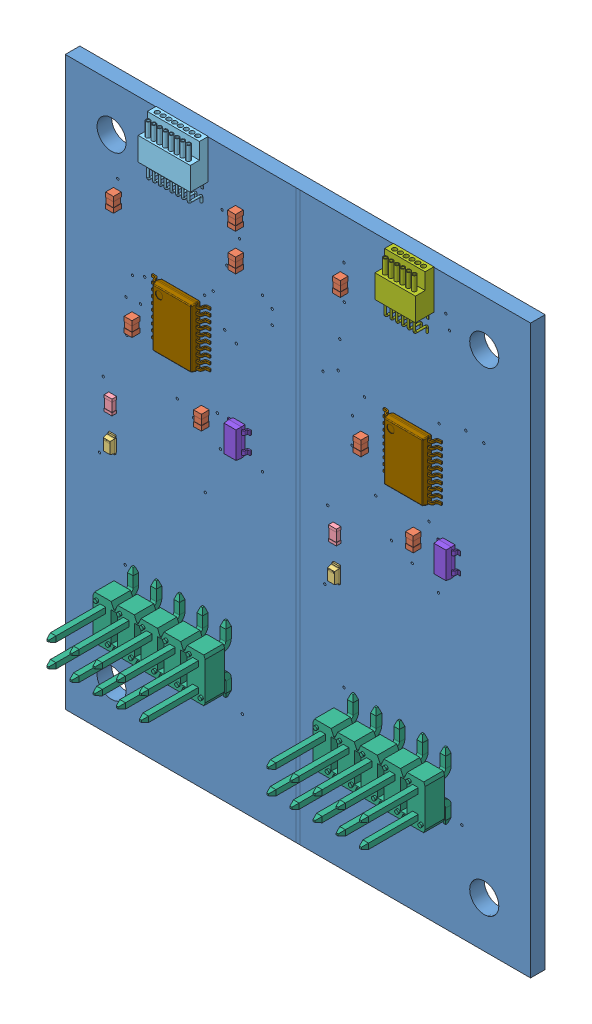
SolidWorks assembly lvds_adapter_v2.SLDASM, configuration Default (file format 15000). Lengths in mm.
Overall size (51.05 62.28 11.26).
21 component instances, 9 part files, 47 mates.
Components (placement in the parent):
- lvds_adapter_v2_PCB-1: lvds_adapter_v2_PCB.SLDPRT [Default] at origin size (51.05 62.23 1.6)
- Capacitor 0603-1: Capacitor 0603.SLDPRT [Default] at (7.747 40.64 1.63) x (0 -1 0) z (-1 0 0) size (1.6 0.86 0.86)
- Capacitor 0603-2: Capacitor 0603.SLDPRT [Default] at (15.367 35.56 1.63) x (0 -1 0) z (-1 0 0) size (1.6 0.86 0.86)
- Capacitor 0603-3: Capacitor 0603.SLDPRT [Default] at (5.715 51.435 1.63) x (0 -1 0) z (-1 0 0) size (1.6 0.86 0.86)
- Capacitor 0603-4: Capacitor 0603.SLDPRT [Default] at (19.1008 56.4134 1.63) x (0 -1 0) z (-1 0 0) size (1.6 0.86 0.86)
- Capacitor 0603-5: Capacitor 0603.SLDPRT [Default] at (19.1262 52.3748 1.63) x (0 -1 0) z (-1 0 0) size (1.6 0.86 0.86)
- Capacitor 0603-6: Capacitor 0603.SLDPRT [Default] at (32.8676 41.8592 1.63) x (0 1 0) z (1 0 0) size (1.6 0.86 0.86)
- Capacitor 0603-7: Capacitor 0603.SLDPRT [Default] at (38.608 35.6108 1.63) x (0 -1 0) z (-1 0 0) size (1.6 0.86 0.86)
- Capacitor 0603-8: Capacitor 0603.SLDPRT [Default] at (30.607 55.88 1.63) x (0 -1 0) z (-1 0 0) size (1.6 0.86 0.86)
- LED 0603-1: LED 0603.SLDPRT [Default] at (5.207 27.94 1.6) x (0 1 0) z (0 0 1) size (1.8 0.92 0.68)
- LED 0603-2: LED 0603.SLDPRT [Default] at (29.8196 27.8892 1.6) x (0 1 0) z (0 0 1) size (1.8 0.92 0.68)
- Resistor 0603-1: Resistor 0603.SLDPRT [Default] at (5.207 31.75 1.63) x (0 1 0) z (1 0 0) size (1.6 0.51 0.86)
- Resistor 0603-2: Resistor 0603.SLDPRT [Default] at (29.8196 31.6992 1.63) x (0 1 0) z (1 0 0) size (1.6 0.51 0.86)
- A79633-001-1: A79633-001.SLDPRT [Default] at (12.827 57.9628 1.6) x (-1 0 0) z (0 1 0) size (5.72 2.06 6.53)
- header_5x2_100mil-1: header_5x2_100mil.SLDPRT [Default] at (12.827 13.97 3.09) size (12.3 7.29 9.66)
- header_5x2_100mil-2: header_5x2_100mil.SLDPRT [Default] at (36.957 13.97 3.09) size (12.3 7.29 9.66)
- A79623-001-1: A79623-001.SLDPRT [Default] at (38.227 57.9628 1.6) x (-1 0 0) z (0 1 0) size (4.45 2.05 6.53)
- SOT 23-5-1: SOT 23-5.SLDPRT [Default] at (19.177 35.56 2.15) x (0 -1 0) z (-1 0 0) size (3 1.1 2.5)
- SOT 23-5-2: SOT 23-5.SLDPRT [Default] at (42.1132 35.56 2.05) x (0 -1 0) z (-1 0 0) size (3 1.1 2.5)
- TSSOP-20-1: TSSOP-20.SLDPRT [Default] at (12.827 43.18 1.6) size (6.4 6.5 1.13)
- TSSOP-20-2: TSSOP-20.SLDPRT [Default] at (38.227 43.18 1.6) size (6.4 6.5 1.13)
Mates (geometry in assembly coordinates):
- Parallel6: parallel aligned: plane of lvds_adapter_v2-1 through (0 0 1.6) normal (0 -1 0); plane of TSSOP-20-1 through (10.627 39.93 1.73) normal (0 -1 0)
- Parallel8: parallel aligned: plane of lvds_adapter_v2-1 through (0 0 1.6) normal (0 -1 0); plane of TSSOP-20-2 through (36.027 39.93 1.73) normal (0 -1 0)
- Parallel9: parallel aligned: plane of lvds_adapter_v2-1 through (51.054 62.23 1.6) normal (0 1 0); plane of A79633-001-1 through (12.827 62.2808 1.6) normal (0 1 0)
- Parallel10: parallel aligned: plane of lvds_adapter_v2-1 through (51.054 62.23 1.6) normal (0 1 0); plane of A79623-001-1 through (36.0045 62.2808 1.6) normal (0 1 0)
- Parallel11: parallel aligned: plane of lvds_adapter_v2-1 through (0 62.23 1.6) normal (-1 0 0); plane of header_5x2_100mil-1 through (6.677 16.57 3.09) normal (-1 0 0)
- Parallel12: parallel aligned: plane of lvds_adapter_v2-1 through (51.054 0 1.6) normal (1 0 0); plane of header_5x2_100mil-2 through (43.107 11.37 3.09) normal (1 0 0)
- Coincident1: coincident anti-aligned: plane of lvds_adapter_v2-1 through (0 0 1.6) normal (0 0 1); plane of A79633-001-1 through (12.827 57.9628 1.6) normal (0 0 -1)
- Parallel13: parallel anti-aligned: plane of lvds_adapter_v2-1 through (0 0 1.6) normal (0 0 1); plane of TSSOP-20-1 through (12.827 43.18 1.73) normal (0 0 -1)
- Coincident3: coincident: plane of lvds_adapter_v2-1 through (0 0 1.6) normal (0 0 1); line of TSSOP-20-1 through (9.6375 40.3775 1.6) axis (0 -1 0)
- Parallel14: parallel aligned: plane of lvds_adapter_v2-1 through (0 0 1.6) normal (0 -1 0); plane of TSSOP-20-1 through (10.627 39.93 1.73) normal (0 -1 0)
- Coincident4: coincident anti-aligned: plane of lvds_adapter_v2-1 through (0 0 1.6) normal (0 0 1); plane of header_5x2_100mil-1 through (7.753 14.6215 1.6) normal (0 0 -1)
- Parallel15: parallel aligned: plane of lvds_adapter_v2-1 through (0 62.23 1.6) normal (-1 0 0); plane of header_5x2_100mil-1 through (6.677 16.57 3.09) normal (-1 0 0)
- Coincident5: coincident anti-aligned: plane of lvds_adapter_v2-1 through (0 0 1.6) normal (0 0 1); plane of A79623-001-1 through (38.227 57.9628 1.6) normal (0 0 -1)
- Parallel16: parallel aligned: plane of lvds_adapter_v2-1 through (51.054 62.23 1.6) normal (0 1 0); plane of A79623-001-1 through (36.0045 62.2808 1.6) normal (0 1 0)
- Parallel17: parallel aligned: plane of lvds_adapter_v2-1 through (0 0 1.6) normal (0 -1 0); plane of TSSOP-20-2 through (36.027 39.93 1.73) normal (0 -1 0)
- Coincident7: coincident: plane of lvds_adapter_v2-1 through (0 0 1.6) normal (0 0 1); line of TSSOP-20-2 through (41.4165 45.3325 1.6) axis (0 1 0)
- Parallel18: parallel anti-aligned: plane of lvds_adapter_v2-1 through (0 0 1.6) normal (0 0 1); plane of TSSOP-20-2 through (38.227 43.18 1.73) normal (0 0 -1)
- Coincident9: coincident anti-aligned: plane of lvds_adapter_v2-1 through (0 0 1.6) normal (0 0 1); plane of header_5x2_100mil-2 through (31.883 14.6215 1.6) normal (0 0 -1)
- Parallel19: parallel aligned: plane of lvds_adapter_v2-1 through (0 0 1.6) normal (0 -1 0); plane of header_5x2_100mil-2 through (43.307 11.555 5.22) normal (0 -1 0)
- Parallel21: parallel aligned: plane of lvds_adapter_v2-1 through (0 0 1.6) normal (0 -1 0); plane of SOT 23-5-1 through (17.0445 34.385 1.875) normal (0 -1 0)
- Coincident12: coincident anti-aligned: plane of lvds_adapter_v2-1 through (0 0 1.6) normal (0 0 1); plane of SOT 23-5-2 through (41.4132 37.06 1.6) normal (0 0 -1)
- Parallel22: parallel aligned: plane of lvds_adapter_v2-1 through (0 0 1.6) normal (0 -1 0); plane of SOT 23-5-2 through (39.9807 34.385 1.775) normal (0 -1 0)
- Coincident13: coincident anti-aligned: plane of lvds_adapter_v2-1 through (0 0 1.6) normal (0 0 1); plane of SOT 23-5-1 through (17.0445 36.735 1.6) normal (0 0 -1)
- Coincident14: coincident anti-aligned: plane of lvds_adapter_v2-1 through (0 0 1.6) normal (0 0 1); plane of Capacitor 0603-4 through (17.646 56.1134 1.6) normal (0 0 -1)
- Parallel23: parallel aligned: plane of lvds_adapter_v2-1 through (51.054 62.23 1.6) normal (0 1 0); plane of Capacitor 0603-4 through (19.5008 57.2134 2.43) normal (0 1 0)
- Coincident15: coincident anti-aligned: plane of lvds_adapter_v2-1 through (0 0 1.6) normal (0 0 1); plane of Capacitor 0603-5 through (17.6714 52.0748 1.6) normal (0 0 -1)
- Parallel24: parallel aligned: plane of lvds_adapter_v2-1 through (51.054 62.23 1.6) normal (0 1 0); plane of Capacitor 0603-5 through (19.5262 53.1748 2.43) normal (0 1 0)
- Coincident16: coincident anti-aligned: plane of lvds_adapter_v2-1 through (0 0 1.6) normal (0 0 1); plane of Capacitor 0603-3 through (4.2602 51.135 1.6) normal (0 0 -1)
- Parallel25: parallel aligned: plane of lvds_adapter_v2-1 through (51.054 62.23 1.6) normal (0 1 0); plane of Capacitor 0603-3 through (6.115 52.235 2.43) normal (0 1 0)
- Coincident17: coincident anti-aligned: plane of lvds_adapter_v2-1 through (0 0 1.6) normal (0 0 1); plane of Capacitor 0603-1 through (6.2922 40.34 1.6) normal (0 0 -1)
- Parallel26: parallel aligned: plane of lvds_adapter_v2-1 through (0 62.23 1.6) normal (-1 0 0); plane of Capacitor 0603-1 through (7.317 41.44 2.43) normal (-1 0 0)
- Coincident18: coincident anti-aligned: plane of lvds_adapter_v2-1 through (0 0 1.6) normal (0 0 1); plane of Capacitor 0603-2 through (13.9122 35.26 1.6) normal (0 0 -1)
- Parallel27: parallel aligned: plane of lvds_adapter_v2-1 through (0 62.23 1.6) normal (-1 0 0); plane of Capacitor 0603-2 through (14.937 36.36 2.43) normal (-1 0 0)
- Coincident19: coincident anti-aligned: plane of lvds_adapter_v2-1 through (0 0 1.6) normal (0 0 1); plane of Resistor 0603-1 through (6.2587 31.25 1.6) normal (0 0 -1)
- Parallel28: parallel aligned: plane of lvds_adapter_v2-1 through (0 62.23 1.6) normal (-1 0 0); plane of Resistor 0603-1 through (4.777 30.95 2.08) normal (-1 0 0)
- Coincident20: coincident anti-aligned: plane of lvds_adapter_v2-1 through (0 0 1.6) normal (0 0 1); plane of LED 0603-1 through (4.826 27.038 1.6) normal (0 0 -1)
- Parallel29: parallel aligned: plane of lvds_adapter_v2-1 through (0 62.23 1.6) normal (-1 0 0); plane of LED 0603-1 through (4.763 28.638 1.651) normal (-1 0 0)
- Coincident22: coincident anti-aligned: plane of lvds_adapter_v2-1 through (0 0 1.6) normal (0 0 1); plane of Capacitor 0603-8 through (29.1522 55.58 1.6) normal (0 0 -1)
- Parallel30: parallel aligned: plane of lvds_adapter_v2-1 through (51.054 62.23 1.6) normal (0 1 0); plane of Capacitor 0603-8 through (31.007 56.68 2.43) normal (0 1 0)
- Coincident23: coincident anti-aligned: plane of lvds_adapter_v2-1 through (0 0 1.6) normal (0 0 1); plane of Capacitor 0603-6 through (34.3224 42.1592 1.6) normal (0 0 -1)
- Parallel31: parallel aligned: plane of lvds_adapter_v2-1 through (51.054 62.23 1.6) normal (0 1 0); plane of Capacitor 0603-6 through (32.4676 42.6592 2.43) normal (0 1 0)
- Coincident24: coincident anti-aligned: plane of lvds_adapter_v2-1 through (0 0 1.6) normal (0 0 1); plane of Capacitor 0603-7 through (37.1532 35.9108 1.6) normal (0 0 -1)
- Parallel32: parallel aligned: plane of lvds_adapter_v2-1 through (51.054 62.23 1.6) normal (0 1 0); plane of Capacitor 0603-7 through (39.008 36.4108 2.43) normal (0 1 0)
- Coincident25: coincident anti-aligned: plane of lvds_adapter_v2-1 through (0 0 1.6) normal (0 0 1); plane of Resistor 0603-2 through (30.8713 32.1992 1.6) normal (0 0 -1)
- Parallel33: parallel aligned: plane of lvds_adapter_v2-1 through (51.054 62.23 1.6) normal (0 1 0); plane of Resistor 0603-2 through (29.4196 32.4992 2.08) normal (0 1 0)
- Coincident26: coincident anti-aligned: plane of lvds_adapter_v2-1 through (0 0 1.6) normal (0 0 1); plane of LED 0603-2 through (29.4386 26.9872 1.6) normal (0 0 -1)
- Parallel34: parallel aligned: plane of lvds_adapter_v2-1 through (51.054 0 1.6) normal (1 0 0); plane of LED 0603-2 through (30.2636 27.1912 1.651) normal (1 0 0)
